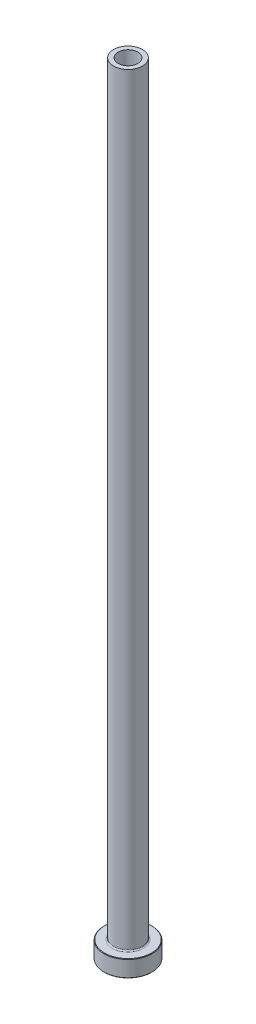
ISO-10303-21;
HEADER;
FILE_DESCRIPTION(('STEP AP214'),'2;1');
FILE_NAME('part.step','',(''),(''),'','','');
FILE_SCHEMA(('AUTOMOTIVE_DESIGN { 1 0 10303 214 1 1 1 1 }'));
ENDSEC;
DATA;
#1=APPLICATION_CONTEXT('core data for automotive mechanical design processes');
#2=APPLICATION_PROTOCOL_DEFINITION('international standard','automotive_design',2000,#1);
#3=PRODUCT_CONTEXT('',#1,'mechanical');
#4=PRODUCT('Part','Part','',(#3));
#5=PRODUCT_RELATED_PRODUCT_CATEGORY('part','',(#4));
#6=PRODUCT_DEFINITION_FORMATION('','',#4);
#7=PRODUCT_DEFINITION_CONTEXT('part definition',#1,'design');
#8=PRODUCT_DEFINITION('design','',#6,#7);
#9=PRODUCT_DEFINITION_SHAPE('','',#8);
#10=(LENGTH_UNIT() NAMED_UNIT(*) SI_UNIT(.MILLI.,.METRE.));
#11=(NAMED_UNIT(*) PLANE_ANGLE_UNIT() SI_UNIT($,.RADIAN.));
#12=(NAMED_UNIT(*) SI_UNIT($,.STERADIAN.) SOLID_ANGLE_UNIT());
#13=UNCERTAINTY_MEASURE_WITH_UNIT(LENGTH_MEASURE(1.E-05),#10,'distance_accuracy_value','');
#14=(GEOMETRIC_REPRESENTATION_CONTEXT(3) GLOBAL_UNCERTAINTY_ASSIGNED_CONTEXT((#13)) GLOBAL_UNIT_ASSIGNED_CONTEXT((#10,
#11,#12)) REPRESENTATION_CONTEXT('',''));
#15=CARTESIAN_POINT('',(0.,0.,0.));
#16=DIRECTION('',(0.,0.,1.));
#17=DIRECTION('',(1.,0.,0.));
#18=AXIS2_PLACEMENT_3D('',#15,#16,#17);
#19=CARTESIAN_POINT('',(0.,92.1876809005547,0.));
#20=DIRECTION('',(0.,1.,0.));
#21=DIRECTION('',(0.,0.,1.));
#22=AXIS2_PLACEMENT_3D('',#19,#20,#21);
#23=CYLINDRICAL_SURFACE('',#22,4.10000000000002);
#24=CARTESIAN_POINT('',(0.,325.,0.));
#25=DIRECTION('',(0.,1.,0.));
#26=DIRECTION('',(0.,0.,1.));
#27=AXIS2_PLACEMENT_3D('',#24,#25,#26);
#28=CIRCLE('',#27,4.10000000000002);
#29=CARTESIAN_POINT('',(0.,325.,4.10000000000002));
#30=VERTEX_POINT('',#29);
#31=EDGE_CURVE('E62',#30,#30,#28,.T.);
#32=ORIENTED_EDGE('',*,*,#31,.T.);
#33=EDGE_LOOP('',(#32));
#34=FACE_BOUND('',#33,.T.);
#35=CARTESIAN_POINT('',(0.,280.,0.));
#36=DIRECTION('',(0.,1.,0.));
#37=DIRECTION('',(0.,0.,1.));
#38=AXIS2_PLACEMENT_3D('',#35,#36,#37);
#39=CIRCLE('',#38,4.10000000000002);
#40=CARTESIAN_POINT('',(0.,280.,4.10000000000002));
#41=VERTEX_POINT('',#40);
#42=EDGE_CURVE('E71',#41,#41,#39,.T.);
#43=ORIENTED_EDGE('',*,*,#42,.F.);
#44=EDGE_LOOP('',(#43));
#45=FACE_BOUND('',#44,.T.);
#46=ADVANCED_FACE('F30',(#34,#45),#23,.F.);
#47=CARTESIAN_POINT('',(-4.10000000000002,325.,0.));
#48=DIRECTION('',(0.,1.,0.));
#49=DIRECTION('',(0.,0.,1.));
#50=AXIS2_PLACEMENT_3D('',#47,#48,#49);
#51=PLANE('',#50);
#52=CARTESIAN_POINT('',(0.,325.,0.));
#53=DIRECTION('',(0.,1.,0.));
#54=DIRECTION('',(0.,0.,1.));
#55=AXIS2_PLACEMENT_3D('',#52,#53,#54);
#56=CIRCLE('',#55,6.00000000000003);
#57=CARTESIAN_POINT('',(0.,325.,6.00000000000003));
#58=VERTEX_POINT('',#57);
#59=EDGE_CURVE('E65',#58,#58,#56,.T.);
#60=ORIENTED_EDGE('',*,*,#59,.T.);
#61=EDGE_LOOP('',(#60));
#62=FACE_BOUND('',#61,.T.);
#63=ORIENTED_EDGE('',*,*,#31,.F.);
#64=EDGE_LOOP('',(#63));
#65=FACE_BOUND('',#64,.T.);
#66=ADVANCED_FACE('F79',(#62,#65),#51,.T.);
#67=CARTESIAN_POINT('',(0.,92.1876809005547,0.));
#68=DIRECTION('',(0.,1.,0.));
#69=DIRECTION('',(0.,0.,1.));
#70=AXIS2_PLACEMENT_3D('',#67,#68,#69);
#71=CYLINDRICAL_SURFACE('',#70,6.00000000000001);
#72=CARTESIAN_POINT('',(0.,7.50000000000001,0.));
#73=DIRECTION('',(0.,1.,0.));
#74=DIRECTION('',(0.,0.,1.));
#75=AXIS2_PLACEMENT_3D('',#72,#73,#74);
#76=CIRCLE('',#75,6.00000000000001);
#77=CARTESIAN_POINT('',(0.,7.50000000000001,6.00000000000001));
#78=VERTEX_POINT('',#77);
#79=EDGE_CURVE('E59',#78,#78,#76,.T.);
#80=ORIENTED_EDGE('',*,*,#79,.T.);
#81=EDGE_LOOP('',(#80));
#82=FACE_BOUND('',#81,.T.);
#83=ORIENTED_EDGE('',*,*,#59,.F.);
#84=EDGE_LOOP('',(#83));
#85=FACE_BOUND('',#84,.T.);
#86=ADVANCED_FACE('F85',(#82,#85),#71,.T.);
#87=CARTESIAN_POINT('',(-5.99999999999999,7.,0.));
#88=DIRECTION('',(0.,1.,0.));
#89=DIRECTION('',(0.,0.,1.));
#90=AXIS2_PLACEMENT_3D('',#87,#88,#89);
#91=PLANE('',#90);
#92=CARTESIAN_POINT('',(0.,7.,0.));
#93=DIRECTION('',(0.,1.,0.));
#94=DIRECTION('',(0.,0.,1.));
#95=AXIS2_PLACEMENT_3D('',#92,#93,#94);
#96=CIRCLE('',#95,9.80000000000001);
#97=CARTESIAN_POINT('',(0.,7.,-9.80000000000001));
#98=VERTEX_POINT('',#97);
#99=EDGE_CURVE('E53',#98,#98,#96,.T.);
#100=ORIENTED_EDGE('',*,*,#99,.T.);
#101=EDGE_LOOP('',(#100));
#102=FACE_BOUND('',#101,.T.);
#103=CARTESIAN_POINT('',(0.,7.,0.));
#104=DIRECTION('',(0.,1.,0.));
#105=DIRECTION('',(0.,0.,1.));
#106=AXIS2_PLACEMENT_3D('',#103,#104,#105);
#107=CIRCLE('',#106,6.50000000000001);
#108=CARTESIAN_POINT('',(0.,7.,6.50000000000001));
#109=VERTEX_POINT('',#108);
#110=EDGE_CURVE('E56',#109,#109,#107,.F.);
#111=ORIENTED_EDGE('',*,*,#110,.T.);
#112=EDGE_LOOP('',(#111));
#113=FACE_BOUND('',#112,.T.);
#114=ADVANCED_FACE('F111',(#102,#113),#91,.T.);
#115=CARTESIAN_POINT('',(0.,92.1876809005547,0.));
#116=DIRECTION('',(0.,1.,0.));
#117=DIRECTION('',(0.,0.,1.));
#118=AXIS2_PLACEMENT_3D('',#115,#116,#117);
#119=CYLINDRICAL_SURFACE('',#118,9.99999999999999);
#120=CARTESIAN_POINT('',(0.,6.80000000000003,0.));
#121=DIRECTION('',(0.,1.,0.));
#122=DIRECTION('',(0.,0.,1.));
#123=AXIS2_PLACEMENT_3D('',#120,#121,#122);
#124=CIRCLE('',#123,9.99999999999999);
#125=CARTESIAN_POINT('',(0.,6.80000000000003,-9.99999999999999));
#126=VERTEX_POINT('',#125);
#127=EDGE_CURVE('E45',#126,#126,#124,.F.);
#128=ORIENTED_EDGE('',*,*,#127,.T.);
#129=EDGE_LOOP('',(#128));
#130=FACE_BOUND('',#129,.T.);
#131=CARTESIAN_POINT('',(0.,0.200000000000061,0.));
#132=DIRECTION('',(0.,-1.,0.));
#133=DIRECTION('',(0.,0.,-1.));
#134=AXIS2_PLACEMENT_3D('',#131,#132,#133);
#135=CIRCLE('',#134,9.99999999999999);
#136=CARTESIAN_POINT('',(0.,0.200000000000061,-9.99999999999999));
#137=VERTEX_POINT('',#136);
#138=EDGE_CURVE('E50',#137,#137,#135,.F.);
#139=ORIENTED_EDGE('',*,*,#138,.T.);
#140=EDGE_LOOP('',(#139));
#141=FACE_BOUND('',#140,.T.);
#142=ADVANCED_FACE('F108',(#130,#141),#119,.T.);
#143=CARTESIAN_POINT('',(-9.99999999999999,0.,0.));
#144=DIRECTION('',(0.,-1.,0.));
#145=DIRECTION('',(0.,0.,-1.));
#146=AXIS2_PLACEMENT_3D('',#143,#144,#145);
#147=PLANE('',#146);
#148=CARTESIAN_POINT('',(0.,0.,0.));
#149=DIRECTION('',(0.,-1.,0.));
#150=DIRECTION('',(0.,0.,-1.));
#151=AXIS2_PLACEMENT_3D('',#148,#149,#150);
#152=CIRCLE('',#151,4.85000000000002);
#153=CARTESIAN_POINT('',(0.,0.,-4.85000000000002));
#154=VERTEX_POINT('',#153);
#155=EDGE_CURVE('E37',#154,#154,#152,.F.);
#156=ORIENTED_EDGE('',*,*,#155,.T.);
#157=EDGE_LOOP('',(#156));
#158=FACE_BOUND('',#157,.T.);
#159=CARTESIAN_POINT('',(0.,0.,0.));
#160=DIRECTION('',(0.,-1.,0.));
#161=DIRECTION('',(0.,0.,-1.));
#162=AXIS2_PLACEMENT_3D('',#159,#160,#161);
#163=CIRCLE('',#162,9.79999999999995);
#164=CARTESIAN_POINT('',(0.,0.,-9.79999999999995));
#165=VERTEX_POINT('',#164);
#166=EDGE_CURVE('E41',#165,#165,#163,.T.);
#167=ORIENTED_EDGE('',*,*,#166,.T.);
#168=EDGE_LOOP('',(#167));
#169=FACE_BOUND('',#168,.T.);
#170=ADVANCED_FACE('F110',(#158,#169),#147,.T.);
#171=CARTESIAN_POINT('',(0.,92.1876809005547,0.));
#172=DIRECTION('',(0.,1.,0.));
#173=DIRECTION('',(0.,0.,1.));
#174=AXIS2_PLACEMENT_3D('',#171,#172,#173);
#175=CYLINDRICAL_SURFACE('',#174,4.35000000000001);
#176=CARTESIAN_POINT('',(0.,0.500000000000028,0.));
#177=DIRECTION('',(0.,-1.,0.));
#178=DIRECTION('',(0.,0.,-1.));
#179=AXIS2_PLACEMENT_3D('',#176,#177,#178);
#180=CIRCLE('',#179,4.35000000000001);
#181=CARTESIAN_POINT('',(0.,0.500000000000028,-4.35000000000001));
#182=VERTEX_POINT('',#181);
#183=EDGE_CURVE('E10',#182,#182,#180,.T.);
#184=ORIENTED_EDGE('',*,*,#183,.T.);
#185=EDGE_LOOP('',(#184));
#186=FACE_BOUND('',#185,.T.);
#187=CARTESIAN_POINT('',(0.,268.,0.));
#188=DIRECTION('',(0.,1.,0.));
#189=DIRECTION('',(0.,0.,1.));
#190=AXIS2_PLACEMENT_3D('',#187,#188,#189);
#191=CIRCLE('',#190,4.35000000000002);
#192=CARTESIAN_POINT('',(0.,268.,4.35000000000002));
#193=VERTEX_POINT('',#192);
#194=EDGE_CURVE('E68',#193,#193,#191,.T.);
#195=ORIENTED_EDGE('',*,*,#194,.T.);
#196=EDGE_LOOP('',(#195));
#197=FACE_BOUND('',#196,.T.);
#198=ADVANCED_FACE('F118',(#186,#197),#175,.F.);
#199=CARTESIAN_POINT('',(0.,268.,0.));
#200=DIRECTION('',(0.,-1.,0.));
#201=DIRECTION('',(0.,0.,-1.));
#202=AXIS2_PLACEMENT_3D('',#199,#200,#201);
#203=CONICAL_SURFACE('',#202,4.35000000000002,0.0208303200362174);
#204=ORIENTED_EDGE('',*,*,#42,.T.);
#205=EDGE_LOOP('',(#204));
#206=FACE_BOUND('',#205,.T.);
#207=ORIENTED_EDGE('',*,*,#194,.F.);
#208=EDGE_LOOP('',(#207));
#209=FACE_BOUND('',#208,.T.);
#210=ADVANCED_FACE('F75',(#206,#209),#203,.F.);
#211=CARTESIAN_POINT('',(0.,7.50000000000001,0.));
#212=DIRECTION('',(0.,1.,0.));
#213=DIRECTION('',(0.,0.,1.));
#214=AXIS2_PLACEMENT_3D('',#211,#212,#213);
#215=TOROIDAL_SURFACE('',#214,6.50000000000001,0.5);
#216=ORIENTED_EDGE('',*,*,#110,.F.);
#217=EDGE_LOOP('',(#216));
#218=FACE_BOUND('',#217,.T.);
#219=ORIENTED_EDGE('',*,*,#79,.F.);
#220=EDGE_LOOP('',(#219));
#221=FACE_BOUND('',#220,.T.);
#222=ADVANCED_FACE('F90',(#218,#221),#215,.F.);
#223=CARTESIAN_POINT('',(0.,7.00000000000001,0.));
#224=DIRECTION('',(0.,-1.,0.));
#225=DIRECTION('',(0.,0.,-1.));
#226=AXIS2_PLACEMENT_3D('',#223,#224,#225);
#227=CONICAL_SURFACE('',#226,9.8,0.785398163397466);
#228=CARTESIAN_POINT('',(0.,6.80000000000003,-9.99999999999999));
#229=CARTESIAN_POINT('',(0.,6.80208333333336,-9.99791666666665));
#230=CARTESIAN_POINT('',(0.,6.80416666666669,-9.99583333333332));
#231=CARTESIAN_POINT('',(0.,6.80833333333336,-9.99166666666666));
#232=CARTESIAN_POINT('',(0.,6.81041666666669,-9.98958333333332));
#233=CARTESIAN_POINT('',(0.,6.81458333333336,-9.98541666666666));
#234=CARTESIAN_POINT('',(0.,6.81666666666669,-9.98333333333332));
#235=CARTESIAN_POINT('',(0.,6.82083333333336,-9.97916666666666));
#236=CARTESIAN_POINT('',(0.,6.82291666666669,-9.97708333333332));
#237=CARTESIAN_POINT('',(0.,6.82708333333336,-9.97291666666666));
#238=CARTESIAN_POINT('',(0.,6.82916666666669,-9.97083333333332));
#239=CARTESIAN_POINT('',(0.,6.83333333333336,-9.96666666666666));
#240=CARTESIAN_POINT('',(0.,6.83541666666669,-9.96458333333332));
#241=CARTESIAN_POINT('',(0.,6.83958333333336,-9.96041666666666));
#242=CARTESIAN_POINT('',(0.,6.84166666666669,-9.95833333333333));
#243=CARTESIAN_POINT('',(0.,6.84583333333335,-9.95416666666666));
#244=CARTESIAN_POINT('',(0.,6.84791666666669,-9.95208333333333));
#245=CARTESIAN_POINT('',(0.,6.85208333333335,-9.94791666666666));
#246=CARTESIAN_POINT('',(0.,6.85416666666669,-9.94583333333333));
#247=CARTESIAN_POINT('',(0.,6.85833333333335,-9.94166666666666));
#248=CARTESIAN_POINT('',(0.,6.86041666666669,-9.93958333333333));
#249=CARTESIAN_POINT('',(0.,6.86458333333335,-9.93541666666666));
#250=CARTESIAN_POINT('',(0.,6.86666666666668,-9.93333333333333));
#251=CARTESIAN_POINT('',(0.,6.87083333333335,-9.92916666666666));
#252=CARTESIAN_POINT('',(0.,6.87291666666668,-9.92708333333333));
#253=CARTESIAN_POINT('',(0.,6.87708333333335,-9.92291666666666));
#254=CARTESIAN_POINT('',(0.,6.87916666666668,-9.92083333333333));
#255=CARTESIAN_POINT('',(0.,6.88333333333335,-9.91666666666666));
#256=CARTESIAN_POINT('',(0.,6.88541666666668,-9.91458333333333));
#257=CARTESIAN_POINT('',(0.,6.88958333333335,-9.91041666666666));
#258=CARTESIAN_POINT('',(0.,6.89166666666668,-9.90833333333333));
#259=CARTESIAN_POINT('',(0.,6.89583333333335,-9.90416666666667));
#260=CARTESIAN_POINT('',(0.,6.89791666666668,-9.90208333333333));
#261=CARTESIAN_POINT('',(0.,6.90208333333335,-9.89791666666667));
#262=CARTESIAN_POINT('',(0.,6.90416666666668,-9.89583333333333));
#263=CARTESIAN_POINT('',(0.,6.90833333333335,-9.89166666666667));
#264=CARTESIAN_POINT('',(0.,6.91041666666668,-9.88958333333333));
#265=CARTESIAN_POINT('',(0.,6.91458333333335,-9.88541666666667));
#266=CARTESIAN_POINT('',(0.,6.91666666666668,-9.88333333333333));
#267=CARTESIAN_POINT('',(0.,6.92083333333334,-9.87916666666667));
#268=CARTESIAN_POINT('',(0.,6.92291666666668,-9.87708333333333));
#269=CARTESIAN_POINT('',(0.,6.92708333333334,-9.87291666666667));
#270=CARTESIAN_POINT('',(0.,6.92916666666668,-9.87083333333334));
#271=CARTESIAN_POINT('',(0.,6.93333333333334,-9.86666666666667));
#272=CARTESIAN_POINT('',(0.,6.93541666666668,-9.86458333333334));
#273=CARTESIAN_POINT('',(0.,6.93958333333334,-9.86041666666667));
#274=CARTESIAN_POINT('',(0.,6.94166666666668,-9.85833333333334));
#275=CARTESIAN_POINT('',(0.,6.94583333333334,-9.85416666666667));
#276=CARTESIAN_POINT('',(0.,6.94791666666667,-9.85208333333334));
#277=CARTESIAN_POINT('',(0.,6.95208333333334,-9.84791666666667));
#278=CARTESIAN_POINT('',(0.,6.95416666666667,-9.84583333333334));
#279=CARTESIAN_POINT('',(0.,6.95833333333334,-9.84166666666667));
#280=CARTESIAN_POINT('',(0.,6.96041666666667,-9.83958333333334));
#281=CARTESIAN_POINT('',(0.,6.96458333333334,-9.83541666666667));
#282=CARTESIAN_POINT('',(0.,6.96666666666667,-9.83333333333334));
#283=CARTESIAN_POINT('',(0.,6.97083333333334,-9.82916666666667));
#284=CARTESIAN_POINT('',(0.,6.97291666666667,-9.82708333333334));
#285=CARTESIAN_POINT('',(0.,6.97708333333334,-9.82291666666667));
#286=CARTESIAN_POINT('',(0.,6.97916666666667,-9.82083333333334));
#287=CARTESIAN_POINT('',(0.,6.98333333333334,-9.81666666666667));
#288=CARTESIAN_POINT('',(0.,6.98541666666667,-9.81458333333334));
#289=CARTESIAN_POINT('',(0.,6.98958333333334,-9.81041666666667));
#290=CARTESIAN_POINT('',(0.,6.99166666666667,-9.80833333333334));
#291=CARTESIAN_POINT('',(0.,6.99583333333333,-9.80416666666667));
#292=CARTESIAN_POINT('',(0.,6.99791666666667,-9.80208333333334));
#293=CARTESIAN_POINT('',(0.,7.,-9.80000000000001));
#294=B_SPLINE_CURVE_WITH_KNOTS('',3,(#228,#229,#230,#231,#232,#233,#234,#235,#236,#237,#238,
#239,#240,#241,#242,#243,#244,#245,#246,#247,#248,#249,#250,#251,#252,#253,#254,#255,#256,#257,
#258,#259,#260,#261,#262,#263,#264,#265,#266,#267,#268,#269,#270,#271,#272,#273,#274,#275,#276,
#277,#278,#279,#280,#281,#282,#283,#284,#285,#286,#287,#288,#289,#290,#291,#292,#293),
.UNSPECIFIED.,.F.,.F.,(4,2,2,2,2,2,2,2,2,2,2,2,2,2,2,2,2,2,2,2,2,2,2,2,2,2,2,2,2,2,2,2,4),(0.,
0.00883883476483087,0.0176776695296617,0.0265165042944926,0.0353553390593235,0.0441941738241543,
0.0530330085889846,0.0618718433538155,0.0707106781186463,0.0795495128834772,0.0883883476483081,
0.0972271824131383,0.106066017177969,0.1149048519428,0.123743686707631,0.132582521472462,
0.141421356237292,0.150260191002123,0.159099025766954,0.167937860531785,0.176776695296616,
0.185615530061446,0.194454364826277,0.203293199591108,0.212132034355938,0.220970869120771,
0.229809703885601,0.238648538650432,0.247487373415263,0.256326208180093,0.265165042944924,
0.274003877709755,0.282842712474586),.UNSPECIFIED.);
#295=EDGE_CURVE('BSEAM93',#126,#98,#294,.T.);
#296=ORIENTED_EDGE('',*,*,#127,.F.);
#297=ORIENTED_EDGE('',*,*,#99,.F.);
#298=ORIENTED_EDGE('',*,*,#295,.T.);
#299=ORIENTED_EDGE('',*,*,#295,.F.);
#300=EDGE_LOOP('',(#296,#298,#297,#299));
#301=FACE_BOUND('',#300,.T.);
#302=ADVANCED_FACE('F93',(#301),#227,.T.);
#303=CARTESIAN_POINT('',(0.,0.200000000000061,0.));
#304=DIRECTION('',(0.,1.,0.));
#305=DIRECTION('',(0.,0.,1.));
#306=AXIS2_PLACEMENT_3D('',#303,#304,#305);
#307=CONICAL_SURFACE('',#306,9.99999999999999,0.785398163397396);
#308=ORIENTED_EDGE('',*,*,#166,.F.);
#309=EDGE_LOOP('',(#308));
#310=FACE_BOUND('',#309,.T.);
#311=ORIENTED_EDGE('',*,*,#138,.F.);
#312=EDGE_LOOP('',(#311));
#313=FACE_BOUND('',#312,.T.);
#314=ADVANCED_FACE('F96',(#310,#313),#307,.T.);
#315=CARTESIAN_POINT('',(0.,0.,0.));
#316=DIRECTION('',(0.,-1.,0.));
#317=DIRECTION('',(0.,0.,-1.));
#318=AXIS2_PLACEMENT_3D('',#315,#316,#317);
#319=CONICAL_SURFACE('',#318,4.85000000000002,0.785398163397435);
#320=ORIENTED_EDGE('',*,*,#183,.F.);
#321=EDGE_LOOP('',(#320));
#322=FACE_BOUND('',#321,.T.);
#323=ORIENTED_EDGE('',*,*,#155,.F.);
#324=EDGE_LOOP('',(#323));
#325=FACE_BOUND('',#324,.T.);
#326=ADVANCED_FACE('F32',(#322,#325),#319,.F.);
#327=CLOSED_SHELL('',(#46,#66,#86,#114,#142,#170,#198,#210,#222,#302,#314,#326));
#328=MANIFOLD_SOLID_BREP('B2',#327);
#329=ADVANCED_BREP_SHAPE_REPRESENTATION('',(#18,#328),#14);
#330=SHAPE_DEFINITION_REPRESENTATION(#9,#329);
ENDSEC;
END-ISO-10303-21;
